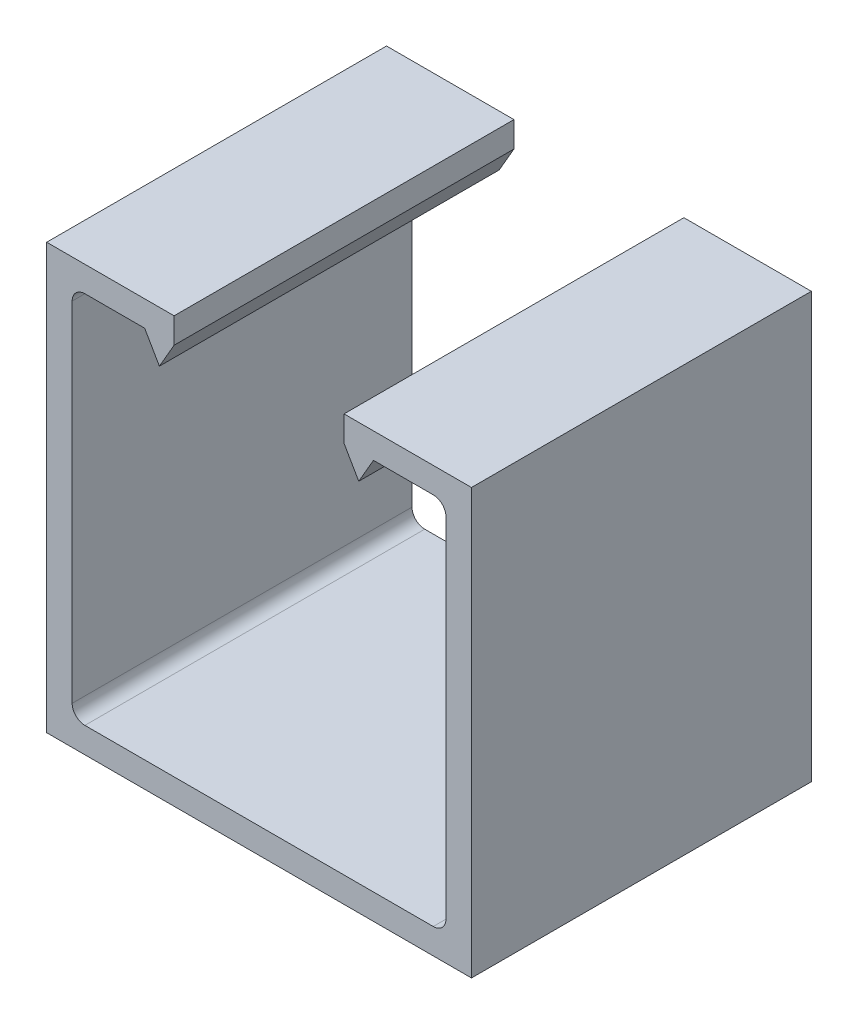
from build123d import *

# Parameters (mm, degrees)
BASE_EXTRUDE_DEPTH = 12.7


with BuildPart() as part:
    # Sketch1 → Base-Extrude (new, symmetric)
    with BuildSketch(Plane.XY):
        with BuildLine():
            Line((-6.35, 15.875), (-15.875, 15.875))
            Line((-15.875, 15.875), (-15.875, -15.875))
            Line((-15.875, -15.875), (15.875, -15.875))
            Line((15.875, -15.875), (15.875, 15.875))
            Line((15.875, 15.875), (6.35, 15.875))
            Line((6.35, 15.875), (6.35, 13.97))
            Line((6.35, 13.97), (7.449852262, 12.065))
            Line((7.449852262, 12.065), (8.549704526, 13.97))
            Line((8.549704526, 13.97), (13.0175, 13.97))
            ThreePointArc((13.0175, 13.97), (13.691019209, 13.691019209), (13.97, 13.0175))
            Line((13.97, 13.0175), (13.97, -13.0175))
            ThreePointArc((13.97, -13.0175), (13.691019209, -13.691019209), (13.0175, -13.97))
            Line((13.0175, -13.97), (-13.0175, -13.97))
            ThreePointArc((-13.0175, -13.97), (-13.691019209, -13.691019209), (-13.97, -13.0175))
            Line((-13.97, -13.0175), (-13.97, 13.0175))
            ThreePointArc((-13.97, 13.0175), (-13.691019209, 13.691019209), (-13.0175, 13.97))
            Line((-13.0175, 13.97), (-8.549704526, 13.97))
            Line((-8.549704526, 13.97), (-7.449852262, 12.065))
            Line((-7.449852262, 12.065), (-6.35, 13.97))
            Line((-6.35, 13.97), (-6.35, 15.875))
        make_face()
    extrude(amount=BASE_EXTRUDE_DEPTH, both=True)


solid = part.part
